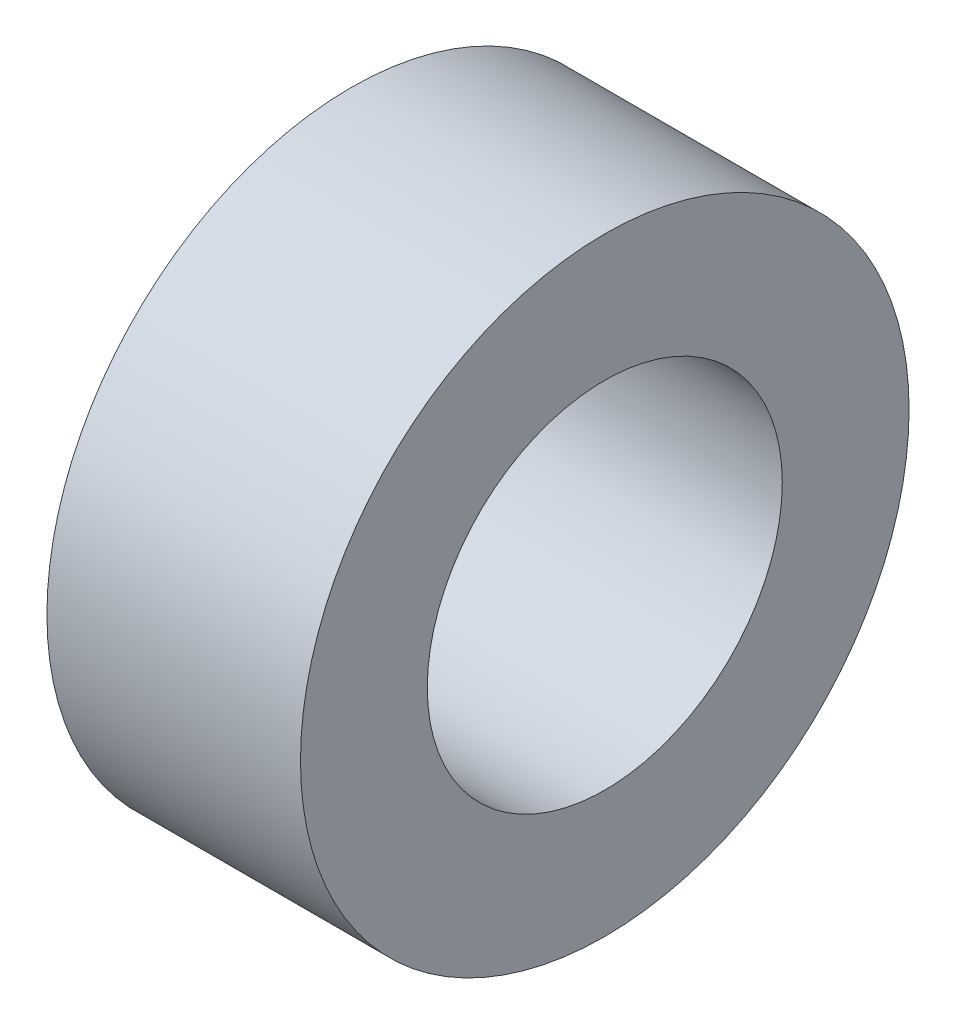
ISO-10303-21;
HEADER;
FILE_DESCRIPTION(('STEP AP214'),'2;1');
FILE_NAME('part.step','',(''),(''),'','','');
FILE_SCHEMA(('AUTOMOTIVE_DESIGN { 1 0 10303 214 1 1 1 1 }'));
ENDSEC;
DATA;
#1=APPLICATION_CONTEXT('core data for automotive mechanical design processes');
#2=APPLICATION_PROTOCOL_DEFINITION('international standard','automotive_design',2000,#1);
#3=PRODUCT_CONTEXT('',#1,'mechanical');
#4=PRODUCT('Part','Part','',(#3));
#5=PRODUCT_RELATED_PRODUCT_CATEGORY('part','',(#4));
#6=PRODUCT_DEFINITION_FORMATION('','',#4);
#7=PRODUCT_DEFINITION_CONTEXT('part definition',#1,'design');
#8=PRODUCT_DEFINITION('design','',#6,#7);
#9=PRODUCT_DEFINITION_SHAPE('','',#8);
#10=(LENGTH_UNIT() NAMED_UNIT(*) SI_UNIT(.MILLI.,.METRE.));
#11=(NAMED_UNIT(*) PLANE_ANGLE_UNIT() SI_UNIT($,.RADIAN.));
#12=(NAMED_UNIT(*) SI_UNIT($,.STERADIAN.) SOLID_ANGLE_UNIT());
#13=UNCERTAINTY_MEASURE_WITH_UNIT(LENGTH_MEASURE(1.E-05),#10,'distance_accuracy_value','');
#14=(GEOMETRIC_REPRESENTATION_CONTEXT(3) GLOBAL_UNCERTAINTY_ASSIGNED_CONTEXT((#13)) GLOBAL_UNIT_ASSIGNED_CONTEXT((#10,
#11,#12)) REPRESENTATION_CONTEXT('',''));
#15=CARTESIAN_POINT('',(0.,0.,0.));
#16=DIRECTION('',(0.,0.,1.));
#17=DIRECTION('',(1.,0.,0.));
#18=AXIS2_PLACEMENT_3D('',#15,#16,#17);
#19=CARTESIAN_POINT('',(8.43184811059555,-1.54895755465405,0.));
#20=DIRECTION('',(-1.,0.,0.));
#21=DIRECTION('',(0.,0.,1.));
#22=AXIS2_PLACEMENT_3D('',#19,#20,#21);
#23=CYLINDRICAL_SURFACE('',#22,3.5);
#24=CARTESIAN_POINT('',(15.889028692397,-1.54895755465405,0.));
#25=DIRECTION('',(-1.,0.,0.));
#26=DIRECTION('',(0.,0.,1.));
#27=AXIS2_PLACEMENT_3D('',#24,#25,#26);
#28=CIRCLE('',#27,3.5);
#29=CARTESIAN_POINT('',(15.889028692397,-1.54895755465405,3.5));
#30=VERTEX_POINT('',#29);
#31=EDGE_CURVE('E10',#30,#30,#28,.T.);
#32=ORIENTED_EDGE('',*,*,#31,.F.);
#33=EDGE_LOOP('',(#32));
#34=FACE_BOUND('',#33,.T.);
#35=CARTESIAN_POINT('',(10.889028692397,-1.54895755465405,0.));
#36=DIRECTION('',(-1.,0.,0.));
#37=DIRECTION('',(0.,0.,1.));
#38=AXIS2_PLACEMENT_3D('',#35,#36,#37);
#39=CIRCLE('',#38,3.5);
#40=CARTESIAN_POINT('',(10.889028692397,-1.54895755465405,3.5));
#41=VERTEX_POINT('',#40);
#42=EDGE_CURVE('E47',#41,#41,#39,.T.);
#43=ORIENTED_EDGE('',*,*,#42,.T.);
#44=EDGE_LOOP('',(#43));
#45=FACE_BOUND('',#44,.T.);
#46=ADVANCED_FACE('F33',(#34,#45),#23,.F.);
#47=CARTESIAN_POINT('',(15.889028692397,1.95104244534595,0.));
#48=DIRECTION('',(-1.,0.,0.));
#49=DIRECTION('',(0.,0.,1.));
#50=AXIS2_PLACEMENT_3D('',#47,#48,#49);
#51=PLANE('',#50);
#52=CARTESIAN_POINT('',(15.889028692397,-1.54895755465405,0.));
#53=DIRECTION('',(-1.,0.,0.));
#54=DIRECTION('',(0.,0.,1.));
#55=AXIS2_PLACEMENT_3D('',#52,#53,#54);
#56=CIRCLE('',#55,6.);
#57=CARTESIAN_POINT('',(15.889028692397,-1.54895755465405,6.));
#58=VERTEX_POINT('',#57);
#59=EDGE_CURVE('E39',#58,#58,#56,.T.);
#60=ORIENTED_EDGE('',*,*,#59,.F.);
#61=EDGE_LOOP('',(#60));
#62=FACE_BOUND('',#61,.T.);
#63=ORIENTED_EDGE('',*,*,#31,.T.);
#64=EDGE_LOOP('',(#63));
#65=FACE_BOUND('',#64,.T.);
#66=ADVANCED_FACE('F62',(#62,#65),#51,.F.);
#67=CARTESIAN_POINT('',(8.43184811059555,-1.54895755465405,0.));
#68=DIRECTION('',(-1.,0.,0.));
#69=DIRECTION('',(0.,0.,1.));
#70=AXIS2_PLACEMENT_3D('',#67,#68,#69);
#71=CYLINDRICAL_SURFACE('',#70,6.);
#72=CARTESIAN_POINT('',(10.889028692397,-1.54895755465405,0.));
#73=DIRECTION('',(-1.,0.,0.));
#74=DIRECTION('',(0.,0.,1.));
#75=AXIS2_PLACEMENT_3D('',#72,#73,#74);
#76=CIRCLE('',#75,6.);
#77=CARTESIAN_POINT('',(10.889028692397,-1.54895755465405,6.));
#78=VERTEX_POINT('',#77);
#79=EDGE_CURVE('E43',#78,#78,#76,.T.);
#80=ORIENTED_EDGE('',*,*,#79,.F.);
#81=EDGE_LOOP('',(#80));
#82=FACE_BOUND('',#81,.T.);
#83=ORIENTED_EDGE('',*,*,#59,.T.);
#84=EDGE_LOOP('',(#83));
#85=FACE_BOUND('',#84,.T.);
#86=ADVANCED_FACE('F57',(#82,#85),#71,.T.);
#87=CARTESIAN_POINT('',(10.889028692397,4.45104244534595,0.));
#88=DIRECTION('',(1.,0.,0.));
#89=DIRECTION('',(0.,0.,-1.));
#90=AXIS2_PLACEMENT_3D('',#87,#88,#89);
#91=PLANE('',#90);
#92=ORIENTED_EDGE('',*,*,#42,.F.);
#93=EDGE_LOOP('',(#92));
#94=FACE_BOUND('',#93,.T.);
#95=ORIENTED_EDGE('',*,*,#79,.T.);
#96=EDGE_LOOP('',(#95));
#97=FACE_BOUND('',#96,.T.);
#98=ADVANCED_FACE('F54',(#94,#97),#91,.F.);
#99=CLOSED_SHELL('',(#46,#66,#86,#98));
#100=MANIFOLD_SOLID_BREP('B2',#99);
#101=ADVANCED_BREP_SHAPE_REPRESENTATION('',(#18,#100),#14);
#102=SHAPE_DEFINITION_REPRESENTATION(#9,#101);
ENDSEC;
END-ISO-10303-21;
